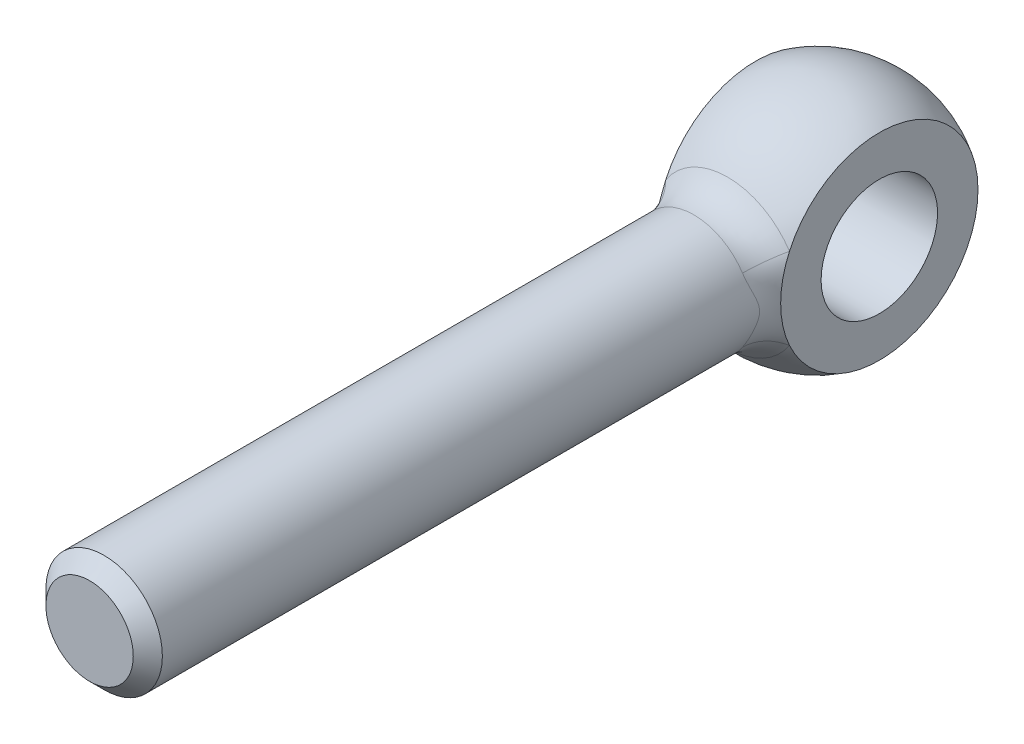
ISO-10303-21;
HEADER;
FILE_DESCRIPTION(('STEP AP214'),'2;1');
FILE_NAME('part.step','',(''),(''),'','','');
FILE_SCHEMA(('AUTOMOTIVE_DESIGN { 1 0 10303 214 1 1 1 1 }'));
ENDSEC;
DATA;
#1=APPLICATION_CONTEXT('core data for automotive mechanical design processes');
#2=APPLICATION_PROTOCOL_DEFINITION('international standard','automotive_design',2000,#1);
#3=PRODUCT_CONTEXT('',#1,'mechanical');
#4=PRODUCT('Part','Part','',(#3));
#5=PRODUCT_RELATED_PRODUCT_CATEGORY('part','',(#4));
#6=PRODUCT_DEFINITION_FORMATION('','',#4);
#7=PRODUCT_DEFINITION_CONTEXT('part definition',#1,'design');
#8=PRODUCT_DEFINITION('design','',#6,#7);
#9=PRODUCT_DEFINITION_SHAPE('','',#8);
#10=(LENGTH_UNIT() NAMED_UNIT(*) SI_UNIT(.MILLI.,.METRE.));
#11=(NAMED_UNIT(*) PLANE_ANGLE_UNIT() SI_UNIT($,.RADIAN.));
#12=(NAMED_UNIT(*) SI_UNIT($,.STERADIAN.) SOLID_ANGLE_UNIT());
#13=UNCERTAINTY_MEASURE_WITH_UNIT(LENGTH_MEASURE(1.E-05),#10,'distance_accuracy_value','');
#14=(GEOMETRIC_REPRESENTATION_CONTEXT(3) GLOBAL_UNCERTAINTY_ASSIGNED_CONTEXT((#13)) GLOBAL_UNIT_ASSIGNED_CONTEXT((#10,
#11,#12)) REPRESENTATION_CONTEXT('',''));
#15=CARTESIAN_POINT('',(0.,0.,0.));
#16=DIRECTION('',(0.,0.,1.));
#17=DIRECTION('',(1.,0.,0.));
#18=AXIS2_PLACEMENT_3D('',#15,#16,#17);
#19=CARTESIAN_POINT('',(0.,0.,0.));
#20=DIRECTION('',(-1.,0.,0.));
#21=DIRECTION('',(0.,0.,-1.));
#22=AXIS2_PLACEMENT_3D('',#19,#20,#21);
#23=SPHERICAL_SURFACE('',#22,16.);
#24=CARTESIAN_POINT('',(8.5,0.,0.));
#25=DIRECTION('',(1.,0.,0.));
#26=DIRECTION('',(0.,0.,1.));
#27=AXIS2_PLACEMENT_3D('',#24,#25,#26);
#28=CIRCLE('',#27,13.555441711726);
#29=CARTESIAN_POINT('',(8.5,5.60530297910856,12.3422274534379));
#30=VERTEX_POINT('',#29);
#31=CARTESIAN_POINT('',(8.5,-5.60530297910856,12.3422274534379));
#32=VERTEX_POINT('',#31);
#33=EDGE_CURVE('E249',#30,#32,#28,.F.);
#34=ORIENTED_EDGE('',*,*,#33,.T.);
#35=CARTESIAN_POINT('',(0.,0.,12.3422274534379));
#36=DIRECTION('',(0.,0.,-1.));
#37=DIRECTION('',(-1.,0.,0.));
#38=AXIS2_PLACEMENT_3D('',#35,#36,#37);
#39=CIRCLE('',#38,10.1818181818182);
#40=CARTESIAN_POINT('',(-8.5,-5.60530297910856,12.3422274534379));
#41=VERTEX_POINT('',#40);
#42=EDGE_CURVE('E72',#32,#41,#39,.T.);
#43=ORIENTED_EDGE('',*,*,#42,.T.);
#44=CARTESIAN_POINT('',(-8.5,0.,0.));
#45=DIRECTION('',(1.,0.,0.));
#46=DIRECTION('',(0.,0.,1.));
#47=AXIS2_PLACEMENT_3D('',#44,#45,#46);
#48=CIRCLE('',#47,13.555441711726);
#49=CARTESIAN_POINT('',(-8.5,5.60530297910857,12.3422274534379));
#50=VERTEX_POINT('',#49);
#51=EDGE_CURVE('E60',#50,#41,#48,.F.);
#52=ORIENTED_EDGE('',*,*,#51,.F.);
#53=CARTESIAN_POINT('',(0.,0.,12.3422274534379));
#54=DIRECTION('',(0.,0.,-1.));
#55=DIRECTION('',(-1.,0.,0.));
#56=AXIS2_PLACEMENT_3D('',#53,#54,#55);
#57=CIRCLE('',#56,10.1818181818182);
#58=EDGE_CURVE('E69',#50,#30,#57,.T.);
#59=ORIENTED_EDGE('',*,*,#58,.T.);
#60=EDGE_LOOP('',(#34,#43,#52,#59));
#61=FACE_BOUND('',#60,.T.);
#62=ADVANCED_FACE('F14',(#61),#23,.T.);
#63=CARTESIAN_POINT('',(0.,0.,-10.));
#64=DIRECTION('',(0.,0.,-1.));
#65=DIRECTION('',(1.,0.,0.));
#66=AXIS2_PLACEMENT_3D('',#63,#64,#65);
#67=CYLINDRICAL_SURFACE('',#66,8.);
#68=CARTESIAN_POINT('',(8.5,7.21404603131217,11.4763905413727));
#69=CARTESIAN_POINT('',(6.09468237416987,5.27266465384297,13.1301049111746));
#70=CARTESIAN_POINT('',(5.37414329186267,5.92609347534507,16.4980627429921));
#71=CARTESIAN_POINT('',(8.5,7.11248168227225,11.5402194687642));
#72=CARTESIAN_POINT('',(6.12063584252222,5.22673391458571,13.2143748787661));
#73=CARTESIAN_POINT('',(5.47521745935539,5.83447064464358,16.5670395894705));
#74=CARTESIAN_POINT('',(8.5,7.00912009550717,11.6033252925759));
#75=CARTESIAN_POINT('',(6.15011431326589,5.17869850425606,13.2964415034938));
#76=CARTESIAN_POINT('',(5.57488056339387,5.73934357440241,16.6279432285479));
#77=CARTESIAN_POINT('',(8.5,6.79823975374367,11.7281301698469));
#78=CARTESIAN_POINT('',(6.21569248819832,5.07719835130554,13.4551021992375));
#79=CARTESIAN_POINT('',(5.77047286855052,5.5426312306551,16.7342322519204));
#80=CARTESIAN_POINT('',(8.5,6.69072095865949,11.7898292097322));
#81=CARTESIAN_POINT('',(6.25173729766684,5.02378952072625,13.5316930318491));
#82=CARTESIAN_POINT('',(5.86640203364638,5.44104589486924,16.7796174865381));
#83=CARTESIAN_POINT('',(8.5,6.47156647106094,11.9115249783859));
#84=CARTESIAN_POINT('',(6.32984302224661,4.91051987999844,13.6784476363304));
#85=CARTESIAN_POINT('',(6.05310068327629,5.23254090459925,16.855289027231));
#86=CARTESIAN_POINT('',(8.5,6.35995651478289,11.9715291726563));
#87=CARTESIAN_POINT('',(6.37181368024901,4.85076320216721,13.7486505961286));
#88=CARTESIAN_POINT('',(6.14389552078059,5.12565346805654,16.8856565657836));
#89=CARTESIAN_POINT('',(8.5,6.13156872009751,12.0900958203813));
#90=CARTESIAN_POINT('',(6.4610620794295,4.72338837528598,13.8824437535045));
#91=CARTESIAN_POINT('',(6.32014497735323,4.90667898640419,16.9324624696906));
#92=CARTESIAN_POINT('',(8.5,6.01479321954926,12.1486589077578));
#93=CARTESIAN_POINT('',(6.50828789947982,4.6558463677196,13.946059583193));
#94=CARTESIAN_POINT('',(6.40560197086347,4.79459429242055,16.9489070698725));
#95=CARTESIAN_POINT('',(8.5,5.84778357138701,12.2293170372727));
#96=CARTESIAN_POINT('',(6.57728162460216,4.55517969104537,14.0300382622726));
#97=CARTESIAN_POINT('',(6.52079058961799,4.6349129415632,16.9628056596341));
#98=CARTESIAN_POINT('',(8.5,5.79993799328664,12.252084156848));
#99=CARTESIAN_POINT('',(6.59714554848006,4.52598470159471,14.0532625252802));
#100=CARTESIAN_POINT('',(6.55301829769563,4.58923484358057,16.9657309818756));
#101=CARTESIAN_POINT('',(8.5,5.70332504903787,12.297354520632));
#102=CARTESIAN_POINT('',(6.63743945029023,4.46617383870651,14.0985544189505));
#103=CARTESIAN_POINT('',(6.61651666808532,4.49720278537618,16.969609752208));
#104=CARTESIAN_POINT('',(8.5,5.65455783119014,12.3198578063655));
#105=CARTESIAN_POINT('',(6.65786724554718,4.43556289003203,14.1206247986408));
#106=CARTESIAN_POINT('',(6.64778748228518,4.45084893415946,16.9705635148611));
#107=CARTESIAN_POINT('',(8.5,5.44499233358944,12.415034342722));
#108=CARTESIAN_POINT('',(6.74556355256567,4.30257834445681,14.2117377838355));
#109=CARTESIAN_POINT('',(6.7787644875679,4.25222888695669,16.9705602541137));
#110=CARTESIAN_POINT('',(8.5,5.27951608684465,12.4864255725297));
#111=CARTESIAN_POINT('',(6.81544368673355,4.19277681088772,14.2754759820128));
#112=CARTESIAN_POINT('',(6.8738000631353,4.09681174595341,16.9604462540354));
#113=CARTESIAN_POINT('',(8.5,4.93715685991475,12.6257147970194));
#114=CARTESIAN_POINT('',(6.95729458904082,3.95635337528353,14.3896247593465));
#115=CARTESIAN_POINT('',(7.052814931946,3.7803320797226,16.9224918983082));
#116=CARTESIAN_POINT('',(8.5,4.76026476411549,12.6936099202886));
#117=CARTESIAN_POINT('',(7.02925378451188,3.82985839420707,14.4401471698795));
#118=CARTESIAN_POINT('',(7.13678522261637,3.61926509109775,16.8946372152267));
#119=CARTESIAN_POINT('',(8.5,4.39291482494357,12.8253889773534));
#120=CARTESIAN_POINT('',(7.17229161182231,3.55899929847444,14.5278930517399));
#121=CARTESIAN_POINT('',(7.29368177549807,3.29171337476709,16.8239398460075));
#122=CARTESIAN_POINT('',(8.5,4.20238277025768,12.8892467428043));
#123=CARTESIAN_POINT('',(7.24340117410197,3.41463018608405,14.5651704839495));
#124=CARTESIAN_POINT('',(7.36653960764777,3.12520218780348,16.7810092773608));
#125=CARTESIAN_POINT('',(8.5,3.80753809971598,13.011354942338));
#126=CARTESIAN_POINT('',(7.38096321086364,3.10891477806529,14.6265101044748));
#127=CARTESIAN_POINT('',(7.50042091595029,2.78863622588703,16.6838597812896));
#128=CARTESIAN_POINT('',(8.5,3.60322970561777,13.069607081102));
#129=CARTESIAN_POINT('',(7.44749590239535,2.94761815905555,14.6507009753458));
#130=CARTESIAN_POINT('',(7.5614479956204,2.61858254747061,16.6296443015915));
#131=CARTESIAN_POINT('',(8.5,3.17298584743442,13.1807823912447));
#132=CARTESIAN_POINT('',(7.57474759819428,2.60343332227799,14.6877992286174));
#133=CARTESIAN_POINT('',(7.6733842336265,2.27017167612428,16.5128228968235));
#134=CARTESIAN_POINT('',(8.5,2.94657965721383,13.2334877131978));
#135=CARTESIAN_POINT('',(7.63536024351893,2.41996241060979,14.7004519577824));
#136=CARTESIAN_POINT('',(7.72392626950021,2.09171968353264,16.4500108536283));
#137=CARTESIAN_POINT('',(8.5,2.47625290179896,13.3295107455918));
#138=CARTESIAN_POINT('',(7.74529937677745,2.0363477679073,14.7158200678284));
#139=CARTESIAN_POINT('',(7.81254675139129,1.73163043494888,16.3242586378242));
#140=CARTESIAN_POINT('',(8.5,2.23231936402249,13.3728214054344));
#141=CARTESIAN_POINT('',(7.7947574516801,1.83605562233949,14.7186001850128));
#142=CARTESIAN_POINT('',(7.85061584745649,1.54999089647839,16.2613184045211));
#143=CARTESIAN_POINT('',(8.5,1.72932083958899,13.4470484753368));
#144=CARTESIAN_POINT('',(7.8788717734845,1.42253007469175,14.7183148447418));
#145=CARTESIAN_POINT('',(7.91382421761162,1.18541297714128,16.1458563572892));
#146=CARTESIAN_POINT('',(8.5,1.47045127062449,13.4780956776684));
#147=CARTESIAN_POINT('',(7.91381483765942,1.20922522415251,14.7153404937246));
#148=CARTESIAN_POINT('',(7.93910079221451,1.00251072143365,16.0932277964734));
#149=CARTESIAN_POINT('',(8.5,1.0714872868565,13.5136874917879));
#150=CARTESIAN_POINT('',(7.95363162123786,0.880715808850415,14.7104020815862));
#151=CARTESIAN_POINT('',(7.96751724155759,0.726106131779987,16.0305359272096));
#152=CARTESIAN_POINT('',(8.5,0.936812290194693,13.5237186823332));
#153=CARTESIAN_POINT('',(7.96480566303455,0.769915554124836,14.7086788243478));
#154=CARTESIAN_POINT('',(7.97540430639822,0.633689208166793,16.0123535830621));
#155=CARTESIAN_POINT('',(8.5,0.664802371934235,13.5398145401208));
#156=CARTESIAN_POINT('',(7.98269305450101,0.546269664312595,14.7056669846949));
#157=CARTESIAN_POINT('',(7.98796994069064,0.448291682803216,15.9827925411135));
#158=CARTESIAN_POINT('',(8.5,0.527468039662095,13.5458800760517));
#159=CARTESIAN_POINT('',(7.98941651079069,0.433369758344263,14.7043770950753));
#160=CARTESIAN_POINT('',(7.99264921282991,0.35531120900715,15.9714123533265));
#161=CARTESIAN_POINT('',(8.5,0.239654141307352,13.5541505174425));
#162=CARTESIAN_POINT('',(7.99857317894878,0.196892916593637,14.7025804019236));
#163=CARTESIAN_POINT('',(7.99901593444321,0.161126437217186,15.9558343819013));
#164=CARTESIAN_POINT('',(8.5,0.0890478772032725,13.555984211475));
#165=CARTESIAN_POINT('',(8.00059991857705,0.0731434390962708,14.7021481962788));
#166=CARTESIAN_POINT('',(8.0004158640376,0.0598937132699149,15.9523278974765));
#167=CARTESIAN_POINT('',(8.5,-0.211895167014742,13.5546208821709));
#168=CARTESIAN_POINT('',(7.99909224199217,-0.174066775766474,14.7024570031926));
#169=CARTESIAN_POINT('',(7.99937082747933,-0.142512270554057,15.9549155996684));
#170=CARTESIAN_POINT('',(8.5,-0.362231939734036,13.5514237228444));
#171=CARTESIAN_POINT('',(7.99555670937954,-0.297606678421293,14.7031982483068));
#172=CARTESIAN_POINT('',(7.99692575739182,-0.243685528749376,15.9610100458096));
#173=CARTESIAN_POINT('',(8.5,-0.660964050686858,13.5401445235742));
#174=CARTESIAN_POINT('',(7.9830580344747,-0.54310062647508,14.7055724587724));
#175=CARTESIAN_POINT('',(7.98821555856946,-0.445703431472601,15.9821361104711));
#176=CARTESIAN_POINT('',(8.5,-0.809356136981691,13.5320551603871));
#177=CARTESIAN_POINT('',(7.97407893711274,-0.665127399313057,14.7072081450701));
#178=CARTESIAN_POINT('',(7.9819447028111,-0.546547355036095,15.9971811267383));
#179=CARTESIAN_POINT('',(8.5,-1.10250796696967,13.5113317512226));
#180=CARTESIAN_POINT('',(7.95100172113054,-0.906226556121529,14.7107414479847));
#181=CARTESIAN_POINT('',(7.96564184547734,-0.74747091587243,16.0347055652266));
#182=CARTESIAN_POINT('',(8.5,-1.24726738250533,13.4986972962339));
#183=CARTESIAN_POINT('',(7.93688956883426,-1.02536545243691,14.712640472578));
#184=CARTESIAN_POINT('',(7.9556095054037,-0.847550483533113,16.0571856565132));
#185=CARTESIAN_POINT('',(8.5,-1.53378246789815,13.4691681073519));
#186=CARTESIAN_POINT('',(7.90378045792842,-1.26114755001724,14.7159214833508));
#187=CARTESIAN_POINT('',(7.93172247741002,-1.0478871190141,16.1079466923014));
#188=CARTESIAN_POINT('',(8.5,-1.67548813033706,13.4522283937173));
#189=CARTESIAN_POINT('',(7.88471399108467,-1.37780407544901,14.7172974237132));
#190=CARTESIAN_POINT('',(7.91782727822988,-1.1481342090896,16.1362882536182));
#191=CARTESIAN_POINT('',(8.5,-1.95382048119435,13.414630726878));
#192=CARTESIAN_POINT('',(7.8422358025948,-1.60676183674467,14.7186738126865));
#193=CARTESIAN_POINT('',(7.88631338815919,-1.34768986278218,16.1966383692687));
#194=CARTESIAN_POINT('',(8.5,-2.09044618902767,13.3939720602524));
#195=CARTESIAN_POINT('',(7.8188022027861,-1.71910774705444,14.7186709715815));
#196=CARTESIAN_POINT('',(7.86869398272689,-1.44699824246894,16.2286476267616));
#197=CARTESIAN_POINT('',(8.5,-2.3584137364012,13.3493943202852));
#198=CARTESIAN_POINT('',(7.76807987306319,-1.93905894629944,14.7165469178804));
#199=CARTESIAN_POINT('',(7.82977168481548,-1.64463169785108,16.2945243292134));
#200=CARTESIAN_POINT('',(8.5,-2.48975818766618,13.3254768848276));
#201=CARTESIAN_POINT('',(7.74077070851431,-2.04670100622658,14.7144201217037));
#202=CARTESIAN_POINT('',(7.80847064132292,-1.74295724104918,16.3283908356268));
#203=CARTESIAN_POINT('',(8.5,-2.74731765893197,13.2747681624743));
#204=CARTESIAN_POINT('',(7.6827657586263,-2.25711370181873,14.707436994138));
#205=CARTESIAN_POINT('',(7.76218797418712,-1.93869867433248,16.3964859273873));
#206=CARTESIAN_POINT('',(8.5,-2.87353234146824,13.2479766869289));
#207=CARTESIAN_POINT('',(7.65204733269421,-2.35990795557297,14.7025700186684));
#208=CARTESIAN_POINT('',(7.73720610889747,-2.03611450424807,16.4307145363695));
#209=CARTESIAN_POINT('',(8.5,-3.20930739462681,13.1718509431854));
#210=CARTESIAN_POINT('',(7.5646325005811,-2.63240368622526,14.6849450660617));
#211=CARTESIAN_POINT('',(7.66441324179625,-2.29923751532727,16.5223425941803));
#212=CARTESIAN_POINT('',(8.5,-3.41408000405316,13.1200716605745));
#213=CARTESIAN_POINT('',(7.50515069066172,-2.79695168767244,14.6690169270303));
#214=CARTESIAN_POINT('',(7.61303164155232,-2.46407698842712,16.5788489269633));
#215=CARTESIAN_POINT('',(8.5,-3.8101120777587,13.0105817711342));
#216=CARTESIAN_POINT('',(7.38026115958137,-3.11070990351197,14.6259549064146));
#217=CARTESIAN_POINT('',(7.49942504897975,-2.79079244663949,16.6841164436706));
#218=CARTESIAN_POINT('',(8.5,-4.0013731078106,12.9528718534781));
#219=CARTESIAN_POINT('',(7.31476500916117,-3.25992435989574,14.5987244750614));
#220=CARTESIAN_POINT('',(7.4372013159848,-2.9526687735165,16.7328785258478));
#221=CARTESIAN_POINT('',(8.5,-4.37000544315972,12.8331713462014));
#222=CARTESIAN_POINT('',(7.18112598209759,-3.5415527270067,14.5324431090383));
#223=CARTESIAN_POINT('',(7.3025070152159,-3.27155812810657,16.8185636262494));
#224=CARTESIAN_POINT('',(8.5,-4.54747917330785,12.7712204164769));
#225=CARTESIAN_POINT('',(7.11294809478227,-3.6740501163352,14.4933793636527));
#226=CARTESIAN_POINT('',(7.2301261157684,-3.42860043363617,16.8555818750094));
#227=CARTESIAN_POINT('',(8.5,-4.89131268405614,12.6435234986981));
#228=CARTESIAN_POINT('',(6.97624175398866,-3.92367860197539,14.4030930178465));
#229=CARTESIAN_POINT('',(7.07492374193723,-3.73837581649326,16.9153731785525));
#230=CARTESIAN_POINT('',(8.5,-5.05767311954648,12.5777777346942));
#231=CARTESIAN_POINT('',(6.90769393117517,-4.04071118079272,14.3517578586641));
#232=CARTESIAN_POINT('',(6.99210288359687,-3.89110914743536,16.938147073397));
#233=CARTESIAN_POINT('',(8.5,-5.36183242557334,12.4508919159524));
#234=CARTESIAN_POINT('',(6.78083422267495,-4.24724413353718,14.243801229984));
#235=CARTESIAN_POINT('',(6.8264689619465,-4.17409181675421,16.9653278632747));
#236=CARTESIAN_POINT('',(8.5,-5.5007230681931,12.3900837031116));
#237=CARTESIAN_POINT('',(6.72220835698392,-4.3383567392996,14.1883306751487));
#238=CARTESIAN_POINT('',(6.74473582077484,-4.3049164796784,16.9715357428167));
#239=CARTESIAN_POINT('',(8.5,-5.77121151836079,12.266426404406));
#240=CARTESIAN_POINT('',(6.60877160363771,-4.50955407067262,14.0685302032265));
#241=CARTESIAN_POINT('',(6.57387157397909,-4.56157646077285,16.969341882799));
#242=CARTESIAN_POINT('',(8.5,-5.90281103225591,12.203577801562));
#243=CARTESIAN_POINT('',(6.55399775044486,-4.58954375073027,14.004143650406));
#244=CARTESIAN_POINT('',(6.48474221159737,-4.6874129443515,16.9609435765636));
#245=CARTESIAN_POINT('',(8.5,-6.16130473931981,12.0751601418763));
#246=CARTESIAN_POINT('',(6.44915440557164,-4.74066397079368,13.866146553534));
#247=CARTESIAN_POINT('',(6.29833410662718,-4.93511082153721,16.9279706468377));
#248=CARTESIAN_POINT('',(8.5,-6.28810151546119,12.0095646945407));
#249=CARTESIAN_POINT('',(6.39923076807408,-4.81153733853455,13.7923798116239));
#250=CARTESIAN_POINT('',(6.2009549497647,-5.05688675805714,16.9031603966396));
#251=CARTESIAN_POINT('',(8.5,-6.53574340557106,11.876602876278));
#252=CARTESIAN_POINT('',(6.3062011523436,-4.94457342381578,13.6370894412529));
#253=CARTESIAN_POINT('',(6.00003403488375,-5.29375902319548,16.8359566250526));
#254=CARTESIAN_POINT('',(8.5,-6.65658306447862,11.8092349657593));
#255=CARTESIAN_POINT('',(6.263172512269,-5.00663411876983,13.5555369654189));
#256=CARTESIAN_POINT('',(5.89648681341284,-5.40884924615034,16.7935473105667));
#257=CARTESIAN_POINT('',(8.5,-6.77474698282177,11.7410733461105));
#258=CARTESIAN_POINT('',(6.22436009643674,-5.06487398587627,13.4708703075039));
#259=CARTESIAN_POINT('',(5.79035913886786,-5.52012146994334,16.7417712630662));
#260=(BOUNDED_SURFACE() B_SPLINE_SURFACE(3,2,((#68,#69,#70),(#71,#72,#73),(#74,#75,#76),(#77,
#78,#79),(#80,#81,#82),(#83,#84,#85),(#86,#87,#88),(#89,#90,#91),(#92,#93,#94),(#95,#96,#97),
(#98,#99,#100),(#101,#102,#103),(#104,#105,#106),(#107,#108,#109),(#110,#111,#112),(#113,#114,
#115),(#116,#117,#118),(#119,#120,#121),(#122,#123,#124),(#125,#126,#127),(#128,#129,#130),
(#131,#132,#133),(#134,#135,#136),(#137,#138,#139),(#140,#141,#142),(#143,#144,#145),(#146,#147,
#148),(#149,#150,#151),(#152,#153,#154),(#155,#156,#157),(#158,#159,#160),(#161,#162,#163),
(#164,#165,#166),(#167,#168,#169),(#170,#171,#172),(#173,#174,#175),(#176,#177,#178),(#179,#180,
#181),(#182,#183,#184),(#185,#186,#187),(#188,#189,#190),(#191,#192,#193),(#194,#195,#196),
(#197,#198,#199),(#200,#201,#202),(#203,#204,#205),(#206,#207,#208),(#209,#210,#211),(#212,#213,
#214),(#215,#216,#217),(#218,#219,#220),(#221,#222,#223),(#224,#225,#226),(#227,#228,#229),
(#230,#231,#232),(#233,#234,#235),(#236,#237,#238),(#239,#240,#241),(#242,#243,#244),(#245,#246,
#247),(#248,#249,#250),(#251,#252,#253),(#254,#255,#256),(#257,#258,#259)),.UNSPECIFIED.,.F.,
.F.,.F.) B_SPLINE_SURFACE_WITH_KNOTS((4,2,2,2,2,2,2,2,2,2,2,2,2,2,2,2,2,2,2,2,2,2,2,2,2,2,2,2,2,
2,2,4),(3,3),(0.,0.745231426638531,1.49047004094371,2.23163223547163,2.97246235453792,
3.26605012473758,3.55959104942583,4.5149839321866,5.47114937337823,6.43298377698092,
7.39452475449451,8.38551461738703,9.3772456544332,10.3580939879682,10.8478915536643,
11.3375817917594,11.8688190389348,12.4000706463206,12.9321194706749,13.4642161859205,
14.0021186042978,14.5401243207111,15.0778606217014,15.6156322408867,16.5371108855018,
17.4584825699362,18.3721796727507,19.2858228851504,20.0950945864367,20.9041760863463,
21.7251332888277,22.5468288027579),(0.,1.),
.UNSPECIFIED.) GEOMETRIC_REPRESENTATION_ITEM() RATIONAL_B_SPLINE_SURFACE(((1.,0.863427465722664,
1.),(1.,0.865862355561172,1.),(1.,0.868408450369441,1.),(1.,0.87370086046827,1.),(1.,
0.876447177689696,1.),(1.,0.882102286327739,1.),(1.,0.885010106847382,1.),(1.,0.890964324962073,
1.),(1.,0.894010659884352,1.),(1.,0.898329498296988,1.),(1.,0.89956260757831,1.),(1.,
0.902040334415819,1.),(1.,0.903284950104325,1.),(1.,0.90859944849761,1.),(1.,0.912712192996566,
1.),(1.,0.920912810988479,1.),(1.,0.925000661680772,1.),(1.,0.933046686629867,1.),(1.,
0.937003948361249,1.),(1.,0.944629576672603,1.),(1.,0.948298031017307,1.),(1.,0.955318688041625,
1.),(1.,0.958657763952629,1.),(1.,0.964735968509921,1.),(1.,0.967474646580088,1.),(1.,
0.97215547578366,1.),(1.,0.97410603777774,1.),(1.,0.976336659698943,1.),(1.,0.976964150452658,
1.),(1.,0.977970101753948,1.),(1.,0.978348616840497,1.),(1.,0.978864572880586,1.),(1.,
0.978978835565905,1.),(1.,0.978893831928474,1.),(1.,0.978694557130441,1.),(1.,0.977990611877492,
1.),(1.,0.977485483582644,1.),(1.,0.976189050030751,1.),(1.,0.975397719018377,1.),(1.,
0.973544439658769,1.),(1.,0.972479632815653,1.),(1.,0.970111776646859,1.),(1.,0.968808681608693,
1.),(1.,0.965992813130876,1.),(1.,0.964480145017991,1.),(1.,0.961271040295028,1.),(1.,
0.959574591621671,1.),(1.,0.954755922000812,1.),(1.,0.951480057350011,1.),(1.,0.944585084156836,
1.),(1.,0.940966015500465,1.),(1.,0.933532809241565,1.),(1.,0.929720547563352,1.),(1.,
0.921986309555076,1.),(1.,0.918064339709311,1.),(1.,0.91066816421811,1.),(1.,0.907193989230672,
1.),(1.,0.900316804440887,1.),(1.,0.896913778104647,1.),(1.,0.890194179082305,1.),(1.,
0.886879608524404,1.),(1.,0.88043978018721,1.),(1.,0.877314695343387,1.),(1.,0.874312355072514,1.))) REPRESENTATION_ITEM('') SURFACE());
#261=CARTESIAN_POINT('',(5.79035913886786,-5.52012146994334,16.7417712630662));
#262=CARTESIAN_POINT('',(5.89648681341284,-5.40884924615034,16.7935473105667));
#263=CARTESIAN_POINT('',(6.00003403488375,-5.29375902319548,16.8359566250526));
#264=CARTESIAN_POINT('',(6.2009549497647,-5.05688675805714,16.9031603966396));
#265=CARTESIAN_POINT('',(6.29833410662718,-4.93511082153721,16.9279706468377));
#266=CARTESIAN_POINT('',(6.48474221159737,-4.6874129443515,16.9609435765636));
#267=CARTESIAN_POINT('',(6.57387157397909,-4.56157646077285,16.969341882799));
#268=CARTESIAN_POINT('',(6.74473582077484,-4.3049164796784,16.9715357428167));
#269=CARTESIAN_POINT('',(6.8264689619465,-4.17409181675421,16.9653278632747));
#270=CARTESIAN_POINT('',(6.99210288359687,-3.89110914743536,16.938147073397));
#271=CARTESIAN_POINT('',(7.07492374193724,-3.73837581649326,16.9153731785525));
#272=CARTESIAN_POINT('',(7.2301261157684,-3.42860043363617,16.8555818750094));
#273=CARTESIAN_POINT('',(7.3025070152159,-3.27155812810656,16.8185636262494));
#274=CARTESIAN_POINT('',(7.4372013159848,-2.9526687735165,16.7328785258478));
#275=CARTESIAN_POINT('',(7.49942504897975,-2.79079244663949,16.6841164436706));
#276=CARTESIAN_POINT('',(7.61303164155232,-2.46407698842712,16.5788489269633));
#277=CARTESIAN_POINT('',(7.66441324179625,-2.29923751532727,16.5223425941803));
#278=CARTESIAN_POINT('',(7.73720610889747,-2.03611450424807,16.4307145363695));
#279=CARTESIAN_POINT('',(7.76218797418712,-1.93869867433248,16.3964859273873));
#280=CARTESIAN_POINT('',(7.80847064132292,-1.74295724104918,16.3283908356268));
#281=CARTESIAN_POINT('',(7.82977168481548,-1.64463169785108,16.2945243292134));
#282=CARTESIAN_POINT('',(7.86869398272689,-1.44699824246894,16.2286476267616));
#283=CARTESIAN_POINT('',(7.88631338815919,-1.34768986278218,16.1966383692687));
#284=CARTESIAN_POINT('',(7.91782727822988,-1.1481342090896,16.1362882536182));
#285=CARTESIAN_POINT('',(7.93172247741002,-1.0478871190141,16.1079466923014));
#286=CARTESIAN_POINT('',(7.9556095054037,-0.847550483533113,16.0571856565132));
#287=CARTESIAN_POINT('',(7.96564184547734,-0.74747091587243,16.0347055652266));
#288=CARTESIAN_POINT('',(7.9819447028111,-0.546547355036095,15.9971811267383));
#289=CARTESIAN_POINT('',(7.98821555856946,-0.445703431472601,15.9821361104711));
#290=CARTESIAN_POINT('',(7.99692575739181,-0.243685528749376,15.9610100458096));
#291=CARTESIAN_POINT('',(7.99937082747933,-0.142512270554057,15.9549155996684));
#292=CARTESIAN_POINT('',(8.0004158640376,0.0598937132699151,15.9523278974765));
#293=CARTESIAN_POINT('',(7.99901593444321,0.161126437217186,15.9558343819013));
#294=CARTESIAN_POINT('',(7.99264921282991,0.35531120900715,15.9714123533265));
#295=CARTESIAN_POINT('',(7.98796994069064,0.448291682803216,15.9827925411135));
#296=CARTESIAN_POINT('',(7.97540430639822,0.633689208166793,16.0123535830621));
#297=CARTESIAN_POINT('',(7.96751724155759,0.726106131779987,16.0305359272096));
#298=CARTESIAN_POINT('',(7.93910079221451,1.00251072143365,16.0932277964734));
#299=CARTESIAN_POINT('',(7.91382421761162,1.18541297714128,16.1458563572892));
#300=CARTESIAN_POINT('',(7.85061584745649,1.54999089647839,16.2613184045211));
#301=CARTESIAN_POINT('',(7.81254675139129,1.73163043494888,16.3242586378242));
#302=CARTESIAN_POINT('',(7.72392626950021,2.09171968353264,16.4500108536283));
#303=CARTESIAN_POINT('',(7.6733842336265,2.27017167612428,16.5128228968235));
#304=CARTESIAN_POINT('',(7.5614479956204,2.61858254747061,16.6296443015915));
#305=CARTESIAN_POINT('',(7.50042091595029,2.78863622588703,16.6838597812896));
#306=CARTESIAN_POINT('',(7.36653960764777,3.12520218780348,16.7810092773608));
#307=CARTESIAN_POINT('',(7.29368177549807,3.29171337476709,16.8239398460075));
#308=CARTESIAN_POINT('',(7.13678522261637,3.61926509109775,16.8946372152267));
#309=CARTESIAN_POINT('',(7.052814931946,3.7803320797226,16.9224918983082));
#310=CARTESIAN_POINT('',(6.8738000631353,4.09681174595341,16.9604462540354));
#311=CARTESIAN_POINT('',(6.7787644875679,4.25222888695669,16.9705602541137));
#312=CARTESIAN_POINT('',(6.64778748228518,4.45084893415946,16.9705635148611));
#313=CARTESIAN_POINT('',(6.61651666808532,4.49720278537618,16.969609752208));
#314=CARTESIAN_POINT('',(6.55301829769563,4.58923484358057,16.9657309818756));
#315=CARTESIAN_POINT('',(6.52079058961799,4.6349129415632,16.9628056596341));
#316=CARTESIAN_POINT('',(6.40560197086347,4.79459429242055,16.9489070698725));
#317=CARTESIAN_POINT('',(6.32014497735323,4.90667898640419,16.9324624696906));
#318=CARTESIAN_POINT('',(6.14389552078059,5.12565346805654,16.8856565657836));
#319=CARTESIAN_POINT('',(6.05310068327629,5.23254090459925,16.855289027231));
#320=CARTESIAN_POINT('',(5.86640203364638,5.44104589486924,16.7796174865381));
#321=CARTESIAN_POINT('',(5.77047286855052,5.5426312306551,16.7342322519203));
#322=CARTESIAN_POINT('',(5.57488056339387,5.73934357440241,16.6279432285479));
#323=CARTESIAN_POINT('',(5.47521745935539,5.83447064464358,16.5670395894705));
#324=CARTESIAN_POINT('',(5.37414329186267,5.92609347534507,16.4980627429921));
#325=B_SPLINE_CURVE_WITH_KNOTS('',3,(#261,#262,#263,#264,#265,#266,#267,#268,#269,#270,#271,
#272,#273,#274,#275,#276,#277,#278,#279,#280,#281,#282,#283,#284,#285,#286,#287,#288,#289,#290,
#291,#292,#293,#294,#295,#296,#297,#298,#299,#300,#301,#302,#303,#304,#305,#306,#307,#308,#309,
#310,#311,#312,#313,#314,#315,#316,#317,#318,#319,#320,#321,#322,#323,#324),.UNSPECIFIED.,.F.,
.F.,(4,2,2,2,2,2,2,2,2,2,2,2,2,2,2,2,2,2,2,2,2,2,2,2,2,2,2,2,2,2,2,4),(0.,0.821695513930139,
1.64265271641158,2.45173421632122,3.26100591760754,4.17464913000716,5.08834623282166,
6.00971791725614,6.93119656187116,7.46896818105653,8.0067044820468,8.54471019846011,
9.08261261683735,9.61470933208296,10.1467581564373,10.6780097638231,11.2092470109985,
11.6989372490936,12.1887348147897,13.1695831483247,14.1613141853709,15.1523040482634,
16.113845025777,17.0756794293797,18.0318448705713,18.9872377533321,19.2807786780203,
19.57436644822,20.3151965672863,21.0563587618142,21.8015973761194,22.5468288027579),.UNSPECIFIED.);
#326=CARTESIAN_POINT('',(6.67857142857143,-4.40416662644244,16.9705627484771));
#327=VERTEX_POINT('',#326);
#328=CARTESIAN_POINT('',(6.67857142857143,4.40416662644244,16.9705627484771));
#329=VERTEX_POINT('',#328);
#330=EDGE_CURVE('E85',#327,#329,#325,.T.);
#331=ORIENTED_EDGE('',*,*,#330,.T.);
#332=CARTESIAN_POINT('',(0.,0.,16.9705627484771));
#333=DIRECTION('',(0.,0.,-1.));
#334=DIRECTION('',(-1.,0.,0.));
#335=AXIS2_PLACEMENT_3D('',#332,#333,#334);
#336=CIRCLE('',#335,8.);
#337=CARTESIAN_POINT('',(-6.67857142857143,4.40416662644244,16.9705627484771));
#338=VERTEX_POINT('',#337);
#339=EDGE_CURVE('E9',#329,#338,#336,.F.);
#340=ORIENTED_EDGE('',*,*,#339,.T.);
#341=CARTESIAN_POINT('',(-8.5,-7.21404612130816,11.4763904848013));
#342=CARTESIAN_POINT('',(-6.09468234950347,-5.27266467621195,13.1301048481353));
#343=CARTESIAN_POINT('',(-5.37414329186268,-5.92609347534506,16.4980627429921));
#344=CARTESIAN_POINT('',(-8.5,-7.11248171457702,11.5402194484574));
#345=CARTESIAN_POINT('',(-6.12063583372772,-5.22673392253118,13.2143748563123));
#346=CARTESIAN_POINT('',(-5.47521745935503,-5.8344706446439,16.5670395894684));
#347=CARTESIAN_POINT('',(-8.5,-7.00912010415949,11.603325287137));
#348=CARTESIAN_POINT('',(-6.15011431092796,-5.17869850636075,13.2964414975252));
#349=CARTESIAN_POINT('',(-5.57488056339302,-5.73934357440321,16.6279432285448));
#350=CARTESIAN_POINT('',(-8.5,-6.79823974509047,11.7281301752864));
#351=CARTESIAN_POINT('',(-6.21569249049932,-5.07719834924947,13.4551022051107));
#352=CARTESIAN_POINT('',(-5.77047286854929,-5.54263123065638,16.7342322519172));
#353=CARTESIAN_POINT('',(-8.5,-6.69072095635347,11.789829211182));
#354=CARTESIAN_POINT('',(-6.25173729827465,-5.02378952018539,13.5316930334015));
#355=CARTESIAN_POINT('',(-5.86640203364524,-5.44104589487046,16.7796174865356));
#356=CARTESIAN_POINT('',(-8.5,-6.47156647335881,11.9115249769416));
#357=CARTESIAN_POINT('',(-6.32984302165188,-4.91051988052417,13.6784476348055));
#358=CARTESIAN_POINT('',(-6.05310068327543,-5.23254090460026,16.8552890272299));
#359=CARTESIAN_POINT('',(-8.5,-6.35995651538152,11.97152917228));
#360=CARTESIAN_POINT('',(-6.37181368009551,-4.85076320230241,13.7486505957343));
#361=CARTESIAN_POINT('',(-6.1438955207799,-5.12565346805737,16.8856565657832));
#362=CARTESIAN_POINT('',(-8.5,-6.13156871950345,12.0900958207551));
#363=CARTESIAN_POINT('',(-6.46106207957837,-4.72338837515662,13.8824437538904));
#364=CARTESIAN_POINT('',(-6.3201449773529,-4.90667898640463,16.9324624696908));
#365=CARTESIAN_POINT('',(-8.5,-6.01479321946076,12.1486589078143));
#366=CARTESIAN_POINT('',(-6.50828789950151,-4.65584636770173,13.946059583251));
#367=CARTESIAN_POINT('',(-6.40560197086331,-4.79459429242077,16.9489070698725));
#368=CARTESIAN_POINT('',(-8.5,-5.84778357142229,12.2293170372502));
#369=CARTESIAN_POINT('',(-6.57728162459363,-4.55517969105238,14.0300382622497));
#370=CARTESIAN_POINT('',(-6.52079058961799,-4.6349129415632,16.9628056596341));
#371=CARTESIAN_POINT('',(-8.5,-5.79993799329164,12.252084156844));
#372=CARTESIAN_POINT('',(-6.59714554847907,-4.52598470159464,14.0532625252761));
#373=CARTESIAN_POINT('',(-6.55301829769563,-4.58923484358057,16.9657309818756));
#374=CARTESIAN_POINT('',(-8.5,-5.70332504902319,12.2973545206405));
#375=CARTESIAN_POINT('',(-6.63743945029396,-4.46617383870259,14.098554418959));
#376=CARTESIAN_POINT('',(-6.61651666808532,-4.49720278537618,16.969609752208));
#377=CARTESIAN_POINT('',(-8.5,-5.65455783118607,12.3198578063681));
#378=CARTESIAN_POINT('',(-6.65786724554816,-4.43556289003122,14.1206247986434));
#379=CARTESIAN_POINT('',(-6.64778748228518,-4.45084893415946,16.9705635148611));
#380=CARTESIAN_POINT('',(-8.5,-5.44499233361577,12.4150343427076));
#381=CARTESIAN_POINT('',(-6.74556355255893,-4.30257834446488,14.2117377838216));
#382=CARTESIAN_POINT('',(-6.7787644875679,-4.25222888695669,16.9705602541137));
#383=CARTESIAN_POINT('',(-8.5,-5.27951608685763,12.4864255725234));
#384=CARTESIAN_POINT('',(-6.8154436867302,-4.19277681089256,14.2754759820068));
#385=CARTESIAN_POINT('',(-6.8738000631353,-4.09681174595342,16.9604462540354));
#386=CARTESIAN_POINT('',(-8.5,-4.93715685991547,12.6257147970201));
#387=CARTESIAN_POINT('',(-6.95729458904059,-3.95635337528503,14.3896247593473));
#388=CARTESIAN_POINT('',(-7.052814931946,-3.78033207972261,16.9224918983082));
#389=CARTESIAN_POINT('',(-8.5,-4.7602647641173,12.6936099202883));
#390=CARTESIAN_POINT('',(-7.02925378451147,-3.8298583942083,14.4401471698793));
#391=CARTESIAN_POINT('',(-7.13678522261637,-3.61926509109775,16.8946372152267));
#392=CARTESIAN_POINT('',(-8.5,-4.39291482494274,12.8253889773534));
#393=CARTESIAN_POINT('',(-7.17229161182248,-3.55899929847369,14.5278930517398));
#394=CARTESIAN_POINT('',(-7.29368177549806,-3.29171337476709,16.8239398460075));
#395=CARTESIAN_POINT('',(-8.5,-4.20238277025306,12.8892467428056));
#396=CARTESIAN_POINT('',(-7.24340117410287,-3.41463018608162,14.5651704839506));
#397=CARTESIAN_POINT('',(-7.36653960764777,-3.12520218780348,16.7810092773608));
#398=CARTESIAN_POINT('',(-8.5,-3.80753809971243,13.0113549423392));
#399=CARTESIAN_POINT('',(-7.38096321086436,-3.10891477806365,14.6265101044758));
#400=CARTESIAN_POINT('',(-7.50042091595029,-2.78863622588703,16.6838597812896));
#401=CARTESIAN_POINT('',(-8.5,-3.60322970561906,13.0696070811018));
#402=CARTESIAN_POINT('',(-7.4474959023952,-2.94761815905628,14.6507009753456));
#403=CARTESIAN_POINT('',(-7.56144799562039,-2.61858254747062,16.6296443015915));
#404=CARTESIAN_POINT('',(-8.5,-3.17298584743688,13.1807823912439));
#405=CARTESIAN_POINT('',(-7.57474759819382,-2.60343332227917,14.6877992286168));
#406=CARTESIAN_POINT('',(-7.67338423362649,-2.27017167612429,16.5128228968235));
#407=CARTESIAN_POINT('',(-8.5,-2.94657965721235,13.233487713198));
#408=CARTESIAN_POINT('',(-7.63536024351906,-2.41996241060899,14.7004519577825));
#409=CARTESIAN_POINT('',(-7.7239262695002,-2.09171968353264,16.4500108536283));
#410=CARTESIAN_POINT('',(-8.5,-2.47625290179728,13.3295107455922));
#411=CARTESIAN_POINT('',(-7.74529937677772,-2.03634776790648,14.7158200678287));
#412=CARTESIAN_POINT('',(-7.81254675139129,-1.73163043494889,16.3242586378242));
#413=CARTESIAN_POINT('',(-8.5,-2.23231936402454,13.3728214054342));
#414=CARTESIAN_POINT('',(-7.79475745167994,-1.83605562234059,14.7186001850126));
#415=CARTESIAN_POINT('',(-7.85061584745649,-1.5499908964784,16.2613184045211));
#416=CARTESIAN_POINT('',(-8.5,-1.72932083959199,13.4470484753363));
#417=CARTESIAN_POINT('',(-7.87887177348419,-1.42253007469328,14.7183148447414));
#418=CARTESIAN_POINT('',(-7.91382421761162,-1.18541297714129,16.1458563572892));
#419=CARTESIAN_POINT('',(-8.5,-1.47045127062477,13.4780956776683));
#420=CARTESIAN_POINT('',(-7.91381483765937,-1.20922522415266,14.7153404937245));
#421=CARTESIAN_POINT('',(-7.93910079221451,-1.00251072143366,16.0932277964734));
#422=CARTESIAN_POINT('',(-8.5,-1.07148728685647,13.5136874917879));
#423=CARTESIAN_POINT('',(-7.95363162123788,-0.880715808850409,14.7104020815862));
#424=CARTESIAN_POINT('',(-7.96751724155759,-0.726106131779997,16.0305359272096));
#425=CARTESIAN_POINT('',(-8.5,-0.93681229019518,13.5237186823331));
#426=CARTESIAN_POINT('',(-7.96480566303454,-0.769915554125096,14.7086788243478));
#427=CARTESIAN_POINT('',(-7.97540430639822,-0.633689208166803,16.0123535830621));
#428=CARTESIAN_POINT('',(-8.5,-0.664802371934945,13.5398145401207));
#429=CARTESIAN_POINT('',(-7.98269305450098,-0.546269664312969,14.7056669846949));
#430=CARTESIAN_POINT('',(-7.98796994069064,-0.448291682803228,15.9827925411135));
#431=CARTESIAN_POINT('',(-8.5,-0.527468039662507,13.5458800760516));
#432=CARTESIAN_POINT('',(-7.98941651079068,-0.433369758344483,14.7043770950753));
#433=CARTESIAN_POINT('',(-7.99264921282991,-0.355311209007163,15.9714123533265));
#434=CARTESIAN_POINT('',(-8.5,-0.239654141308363,13.5541505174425));
#435=CARTESIAN_POINT('',(-7.99857317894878,-0.196892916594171,14.7025804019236));
#436=CARTESIAN_POINT('',(-7.9990159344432,-0.161126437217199,15.9558343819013));
#437=CARTESIAN_POINT('',(-8.5,-0.0890478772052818,13.555984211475));
#438=CARTESIAN_POINT('',(-8.00059991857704,-0.073143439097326,14.7021481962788));
#439=CARTESIAN_POINT('',(-8.0004158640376,-0.0598937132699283,15.9523278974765));
#440=CARTESIAN_POINT('',(-8.5,0.211895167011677,13.554620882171));
#441=CARTESIAN_POINT('',(-7.99909224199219,0.17406677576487,14.7024570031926));
#442=CARTESIAN_POINT('',(-7.99937082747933,0.142512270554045,15.9549155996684));
#443=CARTESIAN_POINT('',(-8.5,0.362231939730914,13.5514237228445));
#444=CARTESIAN_POINT('',(-7.99555670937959,0.297606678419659,14.7031982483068));
#445=CARTESIAN_POINT('',(-7.99692575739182,0.243685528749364,15.9610100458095));
#446=CARTESIAN_POINT('',(-8.5,0.660964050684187,13.5401445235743));
#447=CARTESIAN_POINT('',(-7.98305803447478,0.543100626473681,14.7055724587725));
#448=CARTESIAN_POINT('',(-7.98821555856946,0.445703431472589,15.9821361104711));
#449=CARTESIAN_POINT('',(-8.5,0.80935613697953,13.5320551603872));
#450=CARTESIAN_POINT('',(-7.97407893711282,0.665127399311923,14.7072081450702));
#451=CARTESIAN_POINT('',(-7.9819447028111,0.546547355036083,15.9971811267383));
#452=CARTESIAN_POINT('',(-8.5,1.10250796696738,13.5113317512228));
#453=CARTESIAN_POINT('',(-7.95100172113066,0.906226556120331,14.7107414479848));
#454=CARTESIAN_POINT('',(-7.96564184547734,0.747470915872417,16.0347055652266));
#455=CARTESIAN_POINT('',(-8.5,1.2472673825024,13.4986972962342));
#456=CARTESIAN_POINT('',(-7.93688956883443,1.02536545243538,14.7126404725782));
#457=CARTESIAN_POINT('',(-7.9556095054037,0.8475504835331,16.0571856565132));
#458=CARTESIAN_POINT('',(-8.5,1.53378246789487,13.4691681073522));
#459=CARTESIAN_POINT('',(-7.90378045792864,1.26114755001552,14.715921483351));
#460=CARTESIAN_POINT('',(-7.93172247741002,1.04788711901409,16.1079466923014));
#461=CARTESIAN_POINT('',(-8.5,1.67548813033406,13.4522283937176));
#462=CARTESIAN_POINT('',(-7.88471399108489,1.37780407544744,14.7172974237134));
#463=CARTESIAN_POINT('',(-7.91782727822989,1.14813420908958,16.1362882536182));
#464=CARTESIAN_POINT('',(-8.5,1.95382048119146,13.4146307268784));
#465=CARTESIAN_POINT('',(-7.84223580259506,1.60676183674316,14.7186738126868));
#466=CARTESIAN_POINT('',(-7.8863133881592,1.34768986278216,16.1966383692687));
#467=CARTESIAN_POINT('',(-8.5,2.09044618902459,13.3939720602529));
#468=CARTESIAN_POINT('',(-7.81880220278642,1.71910774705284,14.7186709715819));
#469=CARTESIAN_POINT('',(-7.86869398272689,1.44699824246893,16.2286476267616));
#470=CARTESIAN_POINT('',(-8.5,2.3584137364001,13.3493943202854));
#471=CARTESIAN_POINT('',(-7.76807987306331,1.93905894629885,14.7165469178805));
#472=CARTESIAN_POINT('',(-7.82977168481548,1.64463169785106,16.2945243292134));
#473=CARTESIAN_POINT('',(-8.5,2.48975818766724,13.3254768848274));
#474=CARTESIAN_POINT('',(-7.74077070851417,2.04670100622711,14.7144201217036));
#475=CARTESIAN_POINT('',(-7.80847064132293,1.74295724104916,16.3283908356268));
#476=CARTESIAN_POINT('',(-8.5,2.74731765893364,13.274768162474));
#477=CARTESIAN_POINT('',(-7.68276575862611,2.2571137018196,14.7074369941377));
#478=CARTESIAN_POINT('',(-7.76218797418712,1.93869867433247,16.3964859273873));
#479=CARTESIAN_POINT('',(-8.5,2.87353234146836,13.2479766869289));
#480=CARTESIAN_POINT('',(-7.65204733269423,2.35990795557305,14.7025700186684));
#481=CARTESIAN_POINT('',(-7.73720610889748,2.03611450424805,16.4307145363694));
#482=CARTESIAN_POINT('',(-8.5,3.20930739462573,13.1718509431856));
#483=CARTESIAN_POINT('',(-7.56463250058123,2.63240368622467,14.6849450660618));
#484=CARTESIAN_POINT('',(-7.66441324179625,2.29923751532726,16.5223425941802));
#485=CARTESIAN_POINT('',(-8.5,3.4140800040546,13.120071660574));
#486=CARTESIAN_POINT('',(-7.50515069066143,2.79695168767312,14.6690169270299));
#487=CARTESIAN_POINT('',(-7.61303164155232,2.4640769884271,16.5788489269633));
#488=CARTESIAN_POINT('',(-8.5,3.81011207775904,13.0105817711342));
#489=CARTESIAN_POINT('',(-7.38026115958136,3.11070990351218,14.6259549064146));
#490=CARTESIAN_POINT('',(-7.49942504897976,2.79079244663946,16.6841164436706));
#491=CARTESIAN_POINT('',(-8.5,4.00137310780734,12.9528718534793));
#492=CARTESIAN_POINT('',(-7.31476500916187,3.25992435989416,14.5987244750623));
#493=CARTESIAN_POINT('',(-7.43720131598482,2.95266877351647,16.7328785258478));
#494=CARTESIAN_POINT('',(-8.5,4.37000544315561,12.8331713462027));
#495=CARTESIAN_POINT('',(-7.18112598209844,3.54155272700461,14.5324431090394));
#496=CARTESIAN_POINT('',(-7.30250701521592,3.27155812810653,16.8185636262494));
#497=CARTESIAN_POINT('',(-8.5,4.54747917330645,12.7712204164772));
#498=CARTESIAN_POINT('',(-7.11294809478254,3.67405011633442,14.493379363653));
#499=CARTESIAN_POINT('',(-7.23012611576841,3.42860043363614,16.8555818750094));
#500=CARTESIAN_POINT('',(-8.5,4.89131268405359,12.6435234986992));
#501=CARTESIAN_POINT('',(-6.97624175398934,3.92367860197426,14.4030930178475));
#502=CARTESIAN_POINT('',(-7.07492374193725,3.73837581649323,16.9153731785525));
#503=CARTESIAN_POINT('',(-8.5,5.05767311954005,12.5777777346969));
#504=CARTESIAN_POINT('',(-6.90769393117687,4.04071118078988,14.3517578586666));
#505=CARTESIAN_POINT('',(-6.99210288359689,3.89110914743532,16.938147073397));
#506=CARTESIAN_POINT('',(-8.5,5.36183242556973,12.4508919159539));
#507=CARTESIAN_POINT('',(-6.78083422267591,4.24724413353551,14.2438012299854));
#508=CARTESIAN_POINT('',(-6.82646896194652,4.17409181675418,16.9653278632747));
#509=CARTESIAN_POINT('',(-8.5,5.50072306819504,12.3900837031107));
#510=CARTESIAN_POINT('',(-6.72220835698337,4.3383567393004,14.1883306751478));
#511=CARTESIAN_POINT('',(-6.74473582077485,4.30491647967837,16.9715357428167));
#512=CARTESIAN_POINT('',(-8.5,5.7712115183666,12.2664264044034));
#513=CARTESIAN_POINT('',(-6.60877160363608,4.50955407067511,14.0685302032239));
#514=CARTESIAN_POINT('',(-6.57387157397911,4.56157646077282,16.969341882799));
#515=CARTESIAN_POINT('',(-8.5,5.90281103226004,12.20357780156));
#516=CARTESIAN_POINT('',(-6.55399775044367,4.58954375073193,14.0041436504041));
#517=CARTESIAN_POINT('',(-6.48474221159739,4.68741294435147,16.9609435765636));
#518=CARTESIAN_POINT('',(-8.5,6.16130473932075,12.0751601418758));
#519=CARTESIAN_POINT('',(-6.44915440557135,4.74066397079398,13.8661465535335));
#520=CARTESIAN_POINT('',(-6.2983341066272,4.93511082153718,16.9279706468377));
#521=CARTESIAN_POINT('',(-8.5,6.28810151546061,12.009564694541));
#522=CARTESIAN_POINT('',(-6.39923076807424,4.81153733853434,13.7923798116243));
#523=CARTESIAN_POINT('',(-6.20095494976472,5.05688675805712,16.9031603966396));
#524=CARTESIAN_POINT('',(-8.5,6.5357434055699,11.8766028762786));
#525=CARTESIAN_POINT('',(-6.30620115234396,4.94457342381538,13.6370894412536));
#526=CARTESIAN_POINT('',(-6.00003403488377,5.29375902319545,16.8359566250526));
#527=CARTESIAN_POINT('',(-8.5,6.65658306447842,11.8092349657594));
#528=CARTESIAN_POINT('',(-6.26317251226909,5.00663411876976,13.555536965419));
#529=CARTESIAN_POINT('',(-5.89648681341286,5.40884924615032,16.7935473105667));
#530=CARTESIAN_POINT('',(-8.5,6.77474698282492,11.7410733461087));
#531=CARTESIAN_POINT('',(-6.22436009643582,5.06487398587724,13.470870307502));
#532=CARTESIAN_POINT('',(-5.79035913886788,5.52012146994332,16.7417712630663));
#533=(BOUNDED_SURFACE() B_SPLINE_SURFACE(3,2,((#341,#342,#343),(#344,#345,#346),(#347,#348,
#349),(#350,#351,#352),(#353,#354,#355),(#356,#357,#358),(#359,#360,#361),(#362,#363,#364),
(#365,#366,#367),(#368,#369,#370),(#371,#372,#373),(#374,#375,#376),(#377,#378,#379),(#380,#381,
#382),(#383,#384,#385),(#386,#387,#388),(#389,#390,#391),(#392,#393,#394),(#395,#396,#397),
(#398,#399,#400),(#401,#402,#403),(#404,#405,#406),(#407,#408,#409),(#410,#411,#412),(#413,#414,
#415),(#416,#417,#418),(#419,#420,#421),(#422,#423,#424),(#425,#426,#427),(#428,#429,#430),
(#431,#432,#433),(#434,#435,#436),(#437,#438,#439),(#440,#441,#442),(#443,#444,#445),(#446,#447,
#448),(#449,#450,#451),(#452,#453,#454),(#455,#456,#457),(#458,#459,#460),(#461,#462,#463),
(#464,#465,#466),(#467,#468,#469),(#470,#471,#472),(#473,#474,#475),(#476,#477,#478),(#479,#480,
#481),(#482,#483,#484),(#485,#486,#487),(#488,#489,#490),(#491,#492,#493),(#494,#495,#496),
(#497,#498,#499),(#500,#501,#502),(#503,#504,#505),(#506,#507,#508),(#509,#510,#511),(#512,#513,
#514),(#515,#516,#517),(#518,#519,#520),(#521,#522,#523),(#524,#525,#526),(#527,#528,#529),
(#530,#531,#532)),.UNSPECIFIED.,.F.,.F.,.F.) B_SPLINE_SURFACE_WITH_KNOTS((4,2,2,2,2,2,2,2,2,2,2,
2,2,2,2,2,2,2,2,2,2,2,2,2,2,2,2,2,2,2,2,4),(3,3),(0.,0.745231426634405,1.49047004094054,
2.23163223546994,2.97246235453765,3.26605012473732,3.55959104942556,4.51498393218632,
5.47114937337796,6.43298377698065,7.39452475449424,8.38551461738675,9.37724565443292,
10.3580939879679,10.847891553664,11.3375817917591,11.8688190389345,12.4000706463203,
12.9321194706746,13.4642161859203,14.0021186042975,14.5401243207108,15.0778606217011,
15.6156322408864,16.5371108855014,17.4584825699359,18.3721796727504,19.28582288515,
20.0950945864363,20.904176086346,21.7251332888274,22.5468288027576),(0.,1.),
.UNSPECIFIED.) GEOMETRIC_REPRESENTATION_ITEM() RATIONAL_B_SPLINE_SURFACE(((1.,0.863427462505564,
1.),(1.,0.865862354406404,1.),(1.,0.8684084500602,1.),(1.,0.873700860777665,1.),(1.,
0.87644717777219,1.),(1.,0.882102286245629,1.),(1.,0.885010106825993,1.),(1.,0.89096432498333,
1.),(1.,0.894010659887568,1.),(1.,0.898329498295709,1.),(1.,0.899562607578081,1.),(1.,
0.902040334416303,1.),(1.,0.903284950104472,1.),(1.,0.908599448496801,1.),(1.,0.912712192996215,
1.),(1.,0.920912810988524,1.),(1.,0.925000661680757,1.),(1.,0.933046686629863,1.),(1.,
0.937003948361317,1.),(1.,0.944629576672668,1.),(1.,0.948298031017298,1.),(1.,0.955318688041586,
1.),(1.,0.958657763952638,1.),(1.,0.964735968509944,1.),(1.,0.967474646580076,1.),(1.,
0.972155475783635,1.),(1.,0.974106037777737,1.),(1.,0.976336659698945,1.),(1.,0.976964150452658,
1.),(1.,0.977970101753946,1.),(1.,0.978348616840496,1.),(1.,0.978864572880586,1.),(1.,
0.978978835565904,1.),(1.,0.978893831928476,1.),(1.,0.978694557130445,1.),(1.,0.977990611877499,
1.),(1.,0.97748548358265,1.),(1.,0.97618905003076,1.),(1.,0.975397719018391,1.),(1.,
0.973544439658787,1.),(1.,0.972479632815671,1.),(1.,0.970111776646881,1.),(1.,0.968808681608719,
1.),(1.,0.965992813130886,1.),(1.,0.964480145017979,1.),(1.,0.961271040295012,1.),(1.,
0.959574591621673,1.),(1.,0.954755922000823,1.),(1.,0.951480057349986,1.),(1.,0.944585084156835,
1.),(1.,0.940966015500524,1.),(1.,0.933532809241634,1.),(1.,0.929720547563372,1.),(1.,
0.921986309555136,1.),(1.,0.918064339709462,1.),(1.,0.910668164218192,1.),(1.,0.907193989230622,
1.),(1.,0.90031680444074,1.),(1.,0.896913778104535,1.),(1.,0.890194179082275,1.),(1.,
0.886879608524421,1.),(1.,0.880439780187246,1.),(1.,0.877314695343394,1.),(1.,0.874312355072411,1.))) REPRESENTATION_ITEM('') SURFACE());
#534=CARTESIAN_POINT('',(-5.79035913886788,5.52012146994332,16.7417712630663));
#535=CARTESIAN_POINT('',(-5.89648681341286,5.40884924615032,16.7935473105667));
#536=CARTESIAN_POINT('',(-6.00003403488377,5.29375902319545,16.8359566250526));
#537=CARTESIAN_POINT('',(-6.20095494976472,5.05688675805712,16.9031603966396));
#538=CARTESIAN_POINT('',(-6.2983341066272,4.93511082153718,16.9279706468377));
#539=CARTESIAN_POINT('',(-6.48474221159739,4.68741294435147,16.9609435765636));
#540=CARTESIAN_POINT('',(-6.57387157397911,4.56157646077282,16.969341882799));
#541=CARTESIAN_POINT('',(-6.74473582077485,4.30491647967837,16.9715357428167));
#542=CARTESIAN_POINT('',(-6.82646896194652,4.17409181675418,16.9653278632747));
#543=CARTESIAN_POINT('',(-6.99210288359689,3.89110914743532,16.938147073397));
#544=CARTESIAN_POINT('',(-7.07492374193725,3.73837581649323,16.9153731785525));
#545=CARTESIAN_POINT('',(-7.23012611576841,3.42860043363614,16.8555818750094));
#546=CARTESIAN_POINT('',(-7.30250701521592,3.27155812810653,16.8185636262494));
#547=CARTESIAN_POINT('',(-7.43720131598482,2.95266877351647,16.7328785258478));
#548=CARTESIAN_POINT('',(-7.49942504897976,2.79079244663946,16.6841164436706));
#549=CARTESIAN_POINT('',(-7.61303164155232,2.4640769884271,16.5788489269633));
#550=CARTESIAN_POINT('',(-7.66441324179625,2.29923751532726,16.5223425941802));
#551=CARTESIAN_POINT('',(-7.73720610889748,2.03611450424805,16.4307145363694));
#552=CARTESIAN_POINT('',(-7.76218797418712,1.93869867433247,16.3964859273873));
#553=CARTESIAN_POINT('',(-7.80847064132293,1.74295724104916,16.3283908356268));
#554=CARTESIAN_POINT('',(-7.82977168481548,1.64463169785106,16.2945243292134));
#555=CARTESIAN_POINT('',(-7.86869398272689,1.44699824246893,16.2286476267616));
#556=CARTESIAN_POINT('',(-7.8863133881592,1.34768986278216,16.1966383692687));
#557=CARTESIAN_POINT('',(-7.91782727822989,1.14813420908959,16.1362882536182));
#558=CARTESIAN_POINT('',(-7.93172247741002,1.04788711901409,16.1079466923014));
#559=CARTESIAN_POINT('',(-7.9556095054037,0.8475504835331,16.0571856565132));
#560=CARTESIAN_POINT('',(-7.96564184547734,0.747470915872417,16.0347055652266));
#561=CARTESIAN_POINT('',(-7.9819447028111,0.546547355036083,15.9971811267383));
#562=CARTESIAN_POINT('',(-7.98821555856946,0.445703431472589,15.9821361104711));
#563=CARTESIAN_POINT('',(-7.99692575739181,0.243685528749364,15.9610100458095));
#564=CARTESIAN_POINT('',(-7.99937082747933,0.142512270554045,15.9549155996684));
#565=CARTESIAN_POINT('',(-8.0004158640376,-0.0598937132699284,15.9523278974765));
#566=CARTESIAN_POINT('',(-7.9990159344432,-0.161126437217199,15.9558343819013));
#567=CARTESIAN_POINT('',(-7.99264921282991,-0.355311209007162,15.9714123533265));
#568=CARTESIAN_POINT('',(-7.98796994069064,-0.448291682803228,15.9827925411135));
#569=CARTESIAN_POINT('',(-7.97540430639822,-0.633689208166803,16.0123535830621));
#570=CARTESIAN_POINT('',(-7.96751724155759,-0.726106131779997,16.0305359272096));
#571=CARTESIAN_POINT('',(-7.93910079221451,-1.00251072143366,16.0932277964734));
#572=CARTESIAN_POINT('',(-7.91382421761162,-1.18541297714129,16.1458563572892));
#573=CARTESIAN_POINT('',(-7.85061584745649,-1.5499908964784,16.2613184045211));
#574=CARTESIAN_POINT('',(-7.81254675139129,-1.73163043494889,16.3242586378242));
#575=CARTESIAN_POINT('',(-7.7239262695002,-2.09171968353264,16.4500108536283));
#576=CARTESIAN_POINT('',(-7.67338423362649,-2.27017167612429,16.5128228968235));
#577=CARTESIAN_POINT('',(-7.5614479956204,-2.61858254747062,16.6296443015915));
#578=CARTESIAN_POINT('',(-7.50042091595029,-2.78863622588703,16.6838597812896));
#579=CARTESIAN_POINT('',(-7.36653960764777,-3.12520218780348,16.7810092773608));
#580=CARTESIAN_POINT('',(-7.29368177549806,-3.29171337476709,16.8239398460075));
#581=CARTESIAN_POINT('',(-7.13678522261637,-3.61926509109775,16.8946372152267));
#582=CARTESIAN_POINT('',(-7.052814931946,-3.78033207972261,16.9224918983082));
#583=CARTESIAN_POINT('',(-6.8738000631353,-4.09681174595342,16.9604462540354));
#584=CARTESIAN_POINT('',(-6.7787644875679,-4.2522288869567,16.9705602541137));
#585=CARTESIAN_POINT('',(-6.64778748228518,-4.45084893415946,16.9705635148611));
#586=CARTESIAN_POINT('',(-6.61651666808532,-4.49720278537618,16.969609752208));
#587=CARTESIAN_POINT('',(-6.55301829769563,-4.58923484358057,16.9657309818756));
#588=CARTESIAN_POINT('',(-6.52079058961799,-4.6349129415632,16.9628056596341));
#589=CARTESIAN_POINT('',(-6.40560197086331,-4.79459429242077,16.9489070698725));
#590=CARTESIAN_POINT('',(-6.3201449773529,-4.90667898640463,16.9324624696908));
#591=CARTESIAN_POINT('',(-6.1438955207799,-5.12565346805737,16.8856565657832));
#592=CARTESIAN_POINT('',(-6.05310068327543,-5.23254090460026,16.8552890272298));
#593=CARTESIAN_POINT('',(-5.86640203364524,-5.44104589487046,16.7796174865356));
#594=CARTESIAN_POINT('',(-5.77047286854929,-5.54263123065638,16.7342322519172));
#595=CARTESIAN_POINT('',(-5.57488056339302,-5.73934357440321,16.6279432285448));
#596=CARTESIAN_POINT('',(-5.47521745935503,-5.8344706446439,16.5670395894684));
#597=CARTESIAN_POINT('',(-5.37414329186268,-5.92609347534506,16.4980627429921));
#598=B_SPLINE_CURVE_WITH_KNOTS('',3,(#534,#535,#536,#537,#538,#539,#540,#541,#542,#543,#544,
#545,#546,#547,#548,#549,#550,#551,#552,#553,#554,#555,#556,#557,#558,#559,#560,#561,#562,#563,
#564,#565,#566,#567,#568,#569,#570,#571,#572,#573,#574,#575,#576,#577,#578,#579,#580,#581,#582,
#583,#584,#585,#586,#587,#588,#589,#590,#591,#592,#593,#594,#595,#596,#597),.UNSPECIFIED.,.F.,
.F.,(4,2,2,2,2,2,2,2,2,2,2,2,2,2,2,2,2,2,2,2,2,2,2,2,2,2,2,2,2,2,2,4),(0.,0.821695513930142,
1.64265271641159,2.45173421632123,3.26100591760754,4.17464913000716,5.08834623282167,
6.00971791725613,6.93119656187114,7.46896818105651,8.00670448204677,8.54471019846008,
9.08261261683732,9.61470933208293,10.1467581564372,10.6780097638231,11.2092470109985,
11.6989372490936,12.1887348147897,13.1695831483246,14.1613141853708,15.1523040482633,
16.1138450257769,17.0756794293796,18.0318448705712,18.987237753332,19.2807786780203,
19.5743664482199,20.3151965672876,21.056358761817,21.8015973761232,22.5468288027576),.UNSPECIFIED.);
#599=CARTESIAN_POINT('',(-6.67857142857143,-4.40416662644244,16.9705627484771));
#600=VERTEX_POINT('',#599);
#601=EDGE_CURVE('E27',#338,#600,#598,.T.);
#602=ORIENTED_EDGE('',*,*,#601,.T.);
#603=CARTESIAN_POINT('',(0.,0.,16.9705627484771));
#604=DIRECTION('',(0.,0.,-1.));
#605=DIRECTION('',(-1.,0.,0.));
#606=AXIS2_PLACEMENT_3D('',#603,#604,#605);
#607=CIRCLE('',#606,8.);
#608=EDGE_CURVE('E96',#600,#327,#607,.F.);
#609=ORIENTED_EDGE('',*,*,#608,.T.);
#610=EDGE_LOOP('',(#331,#340,#602,#609));
#611=FACE_BOUND('',#610,.T.);
#612=CARTESIAN_POINT('',(0.,0.,98.));
#613=DIRECTION('',(0.,0.,-1.));
#614=DIRECTION('',(1.,0.,0.));
#615=AXIS2_PLACEMENT_3D('',#612,#613,#614);
#616=CIRCLE('',#615,8.);
#617=CARTESIAN_POINT('',(8.,0.,98.));
#618=VERTEX_POINT('',#617);
#619=EDGE_CURVE('E252',#618,#618,#616,.T.);
#620=ORIENTED_EDGE('',*,*,#619,.T.);
#621=EDGE_LOOP('',(#620));
#622=FACE_BOUND('',#621,.T.);
#623=ADVANCED_FACE('F102',(#611,#622),#67,.T.);
#624=CARTESIAN_POINT('',(0.,0.,100.));
#625=DIRECTION('',(0.,0.,-1.));
#626=DIRECTION('',(1.,0.,0.));
#627=AXIS2_PLACEMENT_3D('',#624,#625,#626);
#628=CONICAL_SURFACE('',#627,6.,0.785398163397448);
#629=ORIENTED_EDGE('',*,*,#619,.F.);
#630=EDGE_LOOP('',(#629));
#631=FACE_BOUND('',#630,.T.);
#632=CARTESIAN_POINT('',(0.,0.,100.));
#633=DIRECTION('',(0.,0.,-1.));
#634=DIRECTION('',(1.,0.,0.));
#635=AXIS2_PLACEMENT_3D('',#632,#633,#634);
#636=CIRCLE('',#635,6.);
#637=CARTESIAN_POINT('',(6.,0.,100.));
#638=VERTEX_POINT('',#637);
#639=EDGE_CURVE('E64',#638,#638,#636,.T.);
#640=ORIENTED_EDGE('',*,*,#639,.T.);
#641=EDGE_LOOP('',(#640));
#642=FACE_BOUND('',#641,.T.);
#643=ADVANCED_FACE('F107',(#631,#642),#628,.T.);
#644=CARTESIAN_POINT('',(0.,-6.,100.));
#645=DIRECTION('',(0.,0.,1.));
#646=DIRECTION('',(-1.,0.,0.));
#647=AXIS2_PLACEMENT_3D('',#644,#645,#646);
#648=PLANE('',#647);
#649=ORIENTED_EDGE('',*,*,#639,.F.);
#650=EDGE_LOOP('',(#649));
#651=FACE_BOUND('',#650,.T.);
#652=ADVANCED_FACE('F167',(#651),#648,.T.);
#653=CARTESIAN_POINT('',(-8.5,15.,-19.9999999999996));
#654=DIRECTION('',(1.,0.,0.));
#655=DIRECTION('',(0.,0.,1.));
#656=AXIS2_PLACEMENT_3D('',#653,#654,#655);
#657=PLANE('',#656);
#658=CARTESIAN_POINT('',(-8.5,0.,0.));
#659=DIRECTION('',(1.,0.,0.));
#660=DIRECTION('',(0.,0.,1.));
#661=AXIS2_PLACEMENT_3D('',#658,#659,#660);
#662=CIRCLE('',#661,8.);
#663=CARTESIAN_POINT('',(-8.5,0.,8.));
#664=VERTEX_POINT('',#663);
#665=EDGE_CURVE('E250',#664,#664,#662,.T.);
#666=ORIENTED_EDGE('',*,*,#665,.T.);
#667=EDGE_LOOP('',(#666));
#668=FACE_BOUND('',#667,.T.);
#669=ORIENTED_EDGE('',*,*,#51,.T.);
#670=EDGE_CURVE('E57',#41,#50,#48,.F.);
#671=ORIENTED_EDGE('',*,*,#670,.T.);
#672=EDGE_LOOP('',(#669,#671));
#673=FACE_BOUND('',#672,.T.);
#674=ADVANCED_FACE('F59',(#668,#673),#657,.F.);
#675=CARTESIAN_POINT('',(8.5,15.,-19.9999999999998));
#676=DIRECTION('',(1.,0.,0.));
#677=DIRECTION('',(0.,0.,1.));
#678=AXIS2_PLACEMENT_3D('',#675,#676,#677);
#679=PLANE('',#678);
#680=CARTESIAN_POINT('',(8.5,0.,0.));
#681=DIRECTION('',(1.,0.,0.));
#682=DIRECTION('',(0.,0.,1.));
#683=AXIS2_PLACEMENT_3D('',#680,#681,#682);
#684=CIRCLE('',#683,8.);
#685=CARTESIAN_POINT('',(8.5,0.,8.));
#686=VERTEX_POINT('',#685);
#687=EDGE_CURVE('E77',#686,#686,#684,.T.);
#688=ORIENTED_EDGE('',*,*,#687,.F.);
#689=EDGE_LOOP('',(#688));
#690=FACE_BOUND('',#689,.T.);
#691=ORIENTED_EDGE('',*,*,#33,.F.);
#692=EDGE_CURVE('E245',#32,#30,#28,.F.);
#693=ORIENTED_EDGE('',*,*,#692,.F.);
#694=EDGE_LOOP('',(#691,#693));
#695=FACE_BOUND('',#694,.T.);
#696=ADVANCED_FACE('F109',(#690,#695),#679,.T.);
#697=CARTESIAN_POINT('',(10.,0.,0.));
#698=DIRECTION('',(-1.,0.,0.));
#699=DIRECTION('',(0.,0.,-1.));
#700=AXIS2_PLACEMENT_3D('',#697,#698,#699);
#701=CYLINDRICAL_SURFACE('',#700,8.);
#702=ORIENTED_EDGE('',*,*,#687,.T.);
#703=EDGE_LOOP('',(#702));
#704=FACE_BOUND('',#703,.T.);
#705=ORIENTED_EDGE('',*,*,#665,.F.);
#706=EDGE_LOOP('',(#705));
#707=FACE_BOUND('',#706,.T.);
#708=ADVANCED_FACE('F123',(#704,#707),#701,.F.);
#709=CARTESIAN_POINT('',(-11.6875,-7.70729159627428,16.9705627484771));
#710=DIRECTION('',(0.550520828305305,-0.834821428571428,0.));
#711=DIRECTION('',(0.834821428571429,0.550520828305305,0.));
#712=AXIS2_PLACEMENT_3D('',#709,#710,#711);
#713=CIRCLE('',#712,6.);
#714=EDGE_CURVE('E78',#600,#41,#713,.F.);
#715=ORIENTED_EDGE('',*,*,#714,.F.);
#716=ORIENTED_EDGE('',*,*,#601,.F.);
#717=CARTESIAN_POINT('',(-11.6875,7.70729159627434,16.9705627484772));
#718=DIRECTION('',(-0.550520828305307,-0.834821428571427,0.));
#719=DIRECTION('',(0.834821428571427,-0.550520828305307,0.));
#720=AXIS2_PLACEMENT_3D('',#717,#718,#719);
#721=CIRCLE('',#720,6.);
#722=EDGE_CURVE('E74',#50,#338,#721,.T.);
#723=ORIENTED_EDGE('',*,*,#722,.F.);
#724=ORIENTED_EDGE('',*,*,#670,.F.);
#725=EDGE_LOOP('',(#715,#716,#723,#724));
#726=FACE_BOUND('',#725,.T.);
#727=ADVANCED_FACE('F75',(#726),#533,.F.);
#728=CARTESIAN_POINT('',(0.,0.,16.9705627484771));
#729=DIRECTION('',(0.,0.,-1.));
#730=DIRECTION('',(-1.,0.,0.));
#731=AXIS2_PLACEMENT_3D('',#728,#729,#730);
#732=TOROIDAL_SURFACE('',#731,14.,6.);
#733=ORIENTED_EDGE('',*,*,#722,.T.);
#734=ORIENTED_EDGE('',*,*,#339,.F.);
#735=CARTESIAN_POINT('',(11.6875,7.70729159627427,16.9705627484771));
#736=DIRECTION('',(-0.550520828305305,0.834821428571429,0.));
#737=DIRECTION('',(-0.834821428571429,-0.550520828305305,0.));
#738=AXIS2_PLACEMENT_3D('',#735,#736,#737);
#739=CIRCLE('',#738,6.);
#740=EDGE_CURVE('E82',#30,#329,#739,.T.);
#741=ORIENTED_EDGE('',*,*,#740,.F.);
#742=ORIENTED_EDGE('',*,*,#58,.F.);
#743=EDGE_LOOP('',(#733,#734,#741,#742));
#744=FACE_BOUND('',#743,.T.);
#745=ADVANCED_FACE('F81',(#744),#732,.F.);
#746=CARTESIAN_POINT('',(0.,0.,16.9705627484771));
#747=DIRECTION('',(0.,0.,-1.));
#748=DIRECTION('',(-1.,0.,0.));
#749=AXIS2_PLACEMENT_3D('',#746,#747,#748);
#750=TOROIDAL_SURFACE('',#749,14.,6.);
#751=ORIENTED_EDGE('',*,*,#714,.T.);
#752=ORIENTED_EDGE('',*,*,#42,.F.);
#753=CARTESIAN_POINT('',(11.6875,-7.70729159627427,16.9705627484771));
#754=DIRECTION('',(-0.550520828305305,-0.834821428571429,0.));
#755=DIRECTION('',(0.834821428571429,-0.550520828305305,0.));
#756=AXIS2_PLACEMENT_3D('',#753,#754,#755);
#757=CIRCLE('',#756,6.);
#758=EDGE_CURVE('E133',#327,#32,#757,.T.);
#759=ORIENTED_EDGE('',*,*,#758,.F.);
#760=ORIENTED_EDGE('',*,*,#608,.F.);
#761=EDGE_LOOP('',(#751,#752,#759,#760));
#762=FACE_BOUND('',#761,.T.);
#763=ADVANCED_FACE('F209',(#762),#750,.F.);
#764=ORIENTED_EDGE('',*,*,#740,.T.);
#765=ORIENTED_EDGE('',*,*,#330,.F.);
#766=ORIENTED_EDGE('',*,*,#758,.T.);
#767=ORIENTED_EDGE('',*,*,#692,.T.);
#768=EDGE_LOOP('',(#764,#765,#766,#767));
#769=FACE_BOUND('',#768,.T.);
#770=ADVANCED_FACE('F113',(#769),#260,.F.);
#771=CLOSED_SHELL('',(#62,#623,#643,#652,#674,#696,#708,#727,#745,#763,#770));
#772=MANIFOLD_SOLID_BREP('B1',#771);
#773=ADVANCED_BREP_SHAPE_REPRESENTATION('',(#18,#772),#14);
#774=SHAPE_DEFINITION_REPRESENTATION(#9,#773);
ENDSEC;
END-ISO-10303-21;
